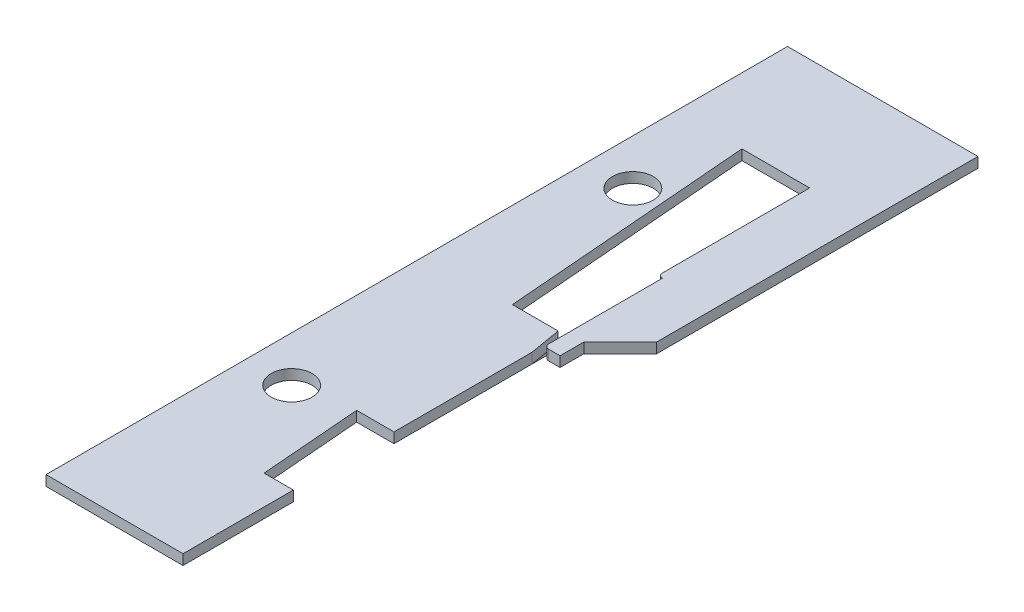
from build123d import *

# Parameters (mm, degrees)
SKETCH11_R          = 1.8
BOSS_EXTRUDE1_DEPTH = 0.9
SKETCH13_W          = 1
SKETCH13_H          = 14
BOSS_EXTRUDE3_DEPTH = 0.4


with BuildPart() as part:
    # Sketch11 → Boss-Extrude1 (new body)
    with BuildSketch(Plane(origin=(0, 0, 0), x_dir=(1, 0, 0), z_dir=(0, 1, 0))):
        with BuildLine():
            Line((43.65, 1.2), (46.85, 4.4))
            Line((46.85, 4.4), (46.85, 32.65))
            Line((46.85, 32.65), (30.1, 32.65))
            Line((30.1, 32.65), (30.1, -32.55))
            Line((30.1, -32.55), (42.15, -32.55))
            Line((42.15, -32.55), (42.15, -22.850000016))
            Line((42.15, -22.850000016), (39.576507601, -22.850000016))
            Line((39.576507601, -22.850000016), (38.862911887, -14.000000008))
            Line((38.862911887, -14.000000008), (42.15, -14.000000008))
            Line((42.15, -14.000000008), (42.15, -1.873333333))
            Line((42.15, -1.873333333), (41.68258427, 0.9))
            Line((41.68258427, 0.9), (37.661490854, 0.9))
            Line((37.661490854, 0.9), (35.89161222, 22.85))
            Line((35.89161222, 22.85), (41.85, 22.85))
            Line((41.85, 22.85), (41.85, 9.9))
            ThreePointArc((41.85, 9.9), (41.967157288, 9.617157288), (42.25, 9.5))
            Line((42.25, 9.5), (42.25, 8.3))
            Line((42.25, 8.3), (42.25, -0.5))
            ThreePointArc((42.25, -0.5), (42.367157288, -0.782842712), (42.65, -0.9))
            Line((42.65, -0.9), (43.65, -0.9))
            Line((43.65, -0.9), (43.65, 1.2))
        make_face()
        with Locations(Location((34.1, -14.95, 0), (0, 0, 270))):
            Circle(SKETCH11_R, mode=Mode.SUBTRACT)
        with Locations(Location((34.1, 15.05, 0), (0, 0, 270))):
            Circle(SKETCH11_R, mode=Mode.SUBTRACT)
    extrude(amount=BOSS_EXTRUDE1_DEPTH)

    # Sketch13 → Boss-Extrude3 (add)
    with BuildSketch(Plane(origin=(0, 0, 0), x_dir=(1, 0, 0), z_dir=(0, 1, 0))):
        with Locations((42.75, 6.5)):
            Rectangle(SKETCH13_W, SKETCH13_H)
        with Locations((41.25, -6.5)):
            Rectangle(SKETCH13_W, SKETCH13_H)
    extrude(amount=-BOSS_EXTRUDE3_DEPTH)


solid = part.part
